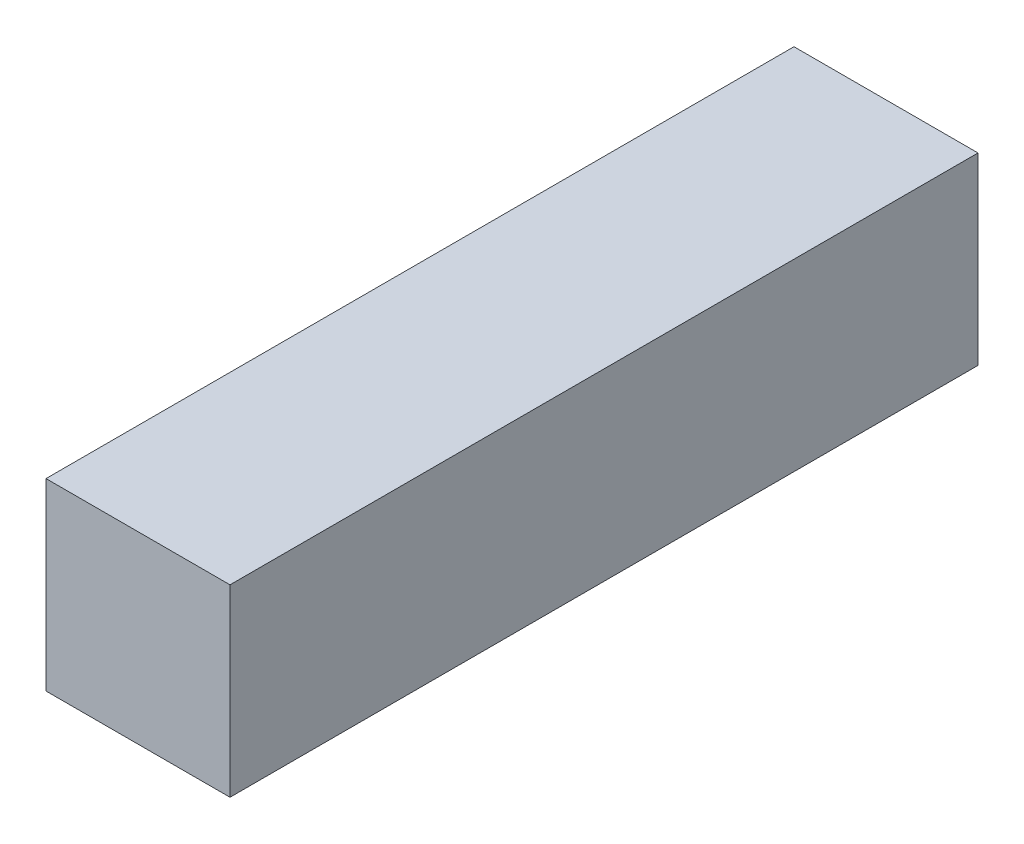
from build123d import *

# Parameters (mm, degrees)
SKETCH1_W           = 8.13
SKETCH1_H           = 2
BOSS_EXTRUDE1_DEPTH = 2


with BuildPart() as part:
    # Sketch1 → Boss-Extrude1 (new body)
    with BuildSketch(Plane(origin=(0, 0, 0), x_dir=(0, 0, -1), z_dir=(1, 0, 0))):
        with Locations((-97.814296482, 0.571030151)):
            Rectangle(SKETCH1_W, SKETCH1_H)
    extrude(amount=BOSS_EXTRUDE1_DEPTH)


solid = part.part
